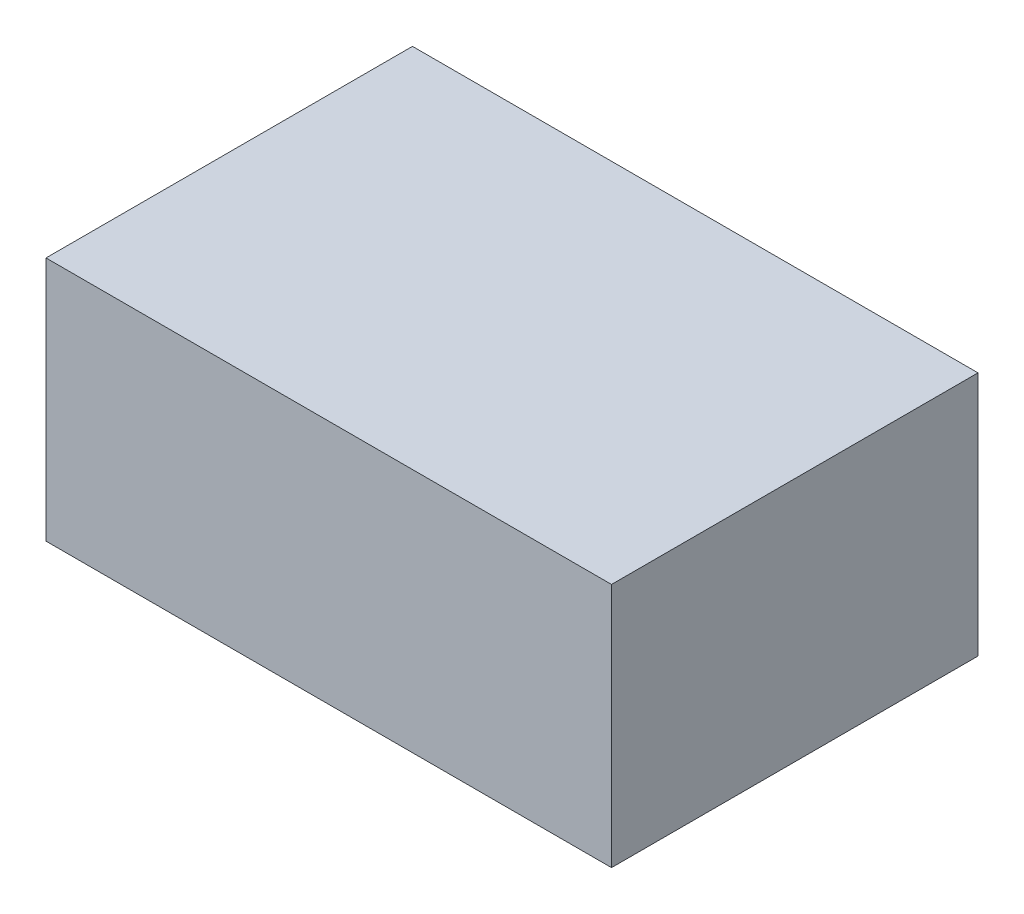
from build123d import *

# Parameters (mm, degrees)
SKETCH1_W      = 111.754758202
SKETCH1_H      = 72.421885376
EXTRUDE1_DEPTH = 48.469120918


with BuildPart() as part:
    # Sketch1 → Extrude1 (new body)
    with BuildSketch(Plane(origin=(0, 0, 0), x_dir=(1, 0, 0), z_dir=(0, 1, 0))):
        Rectangle(SKETCH1_W, SKETCH1_H)
    extrude(amount=EXTRUDE1_DEPTH)


solid = part.part
